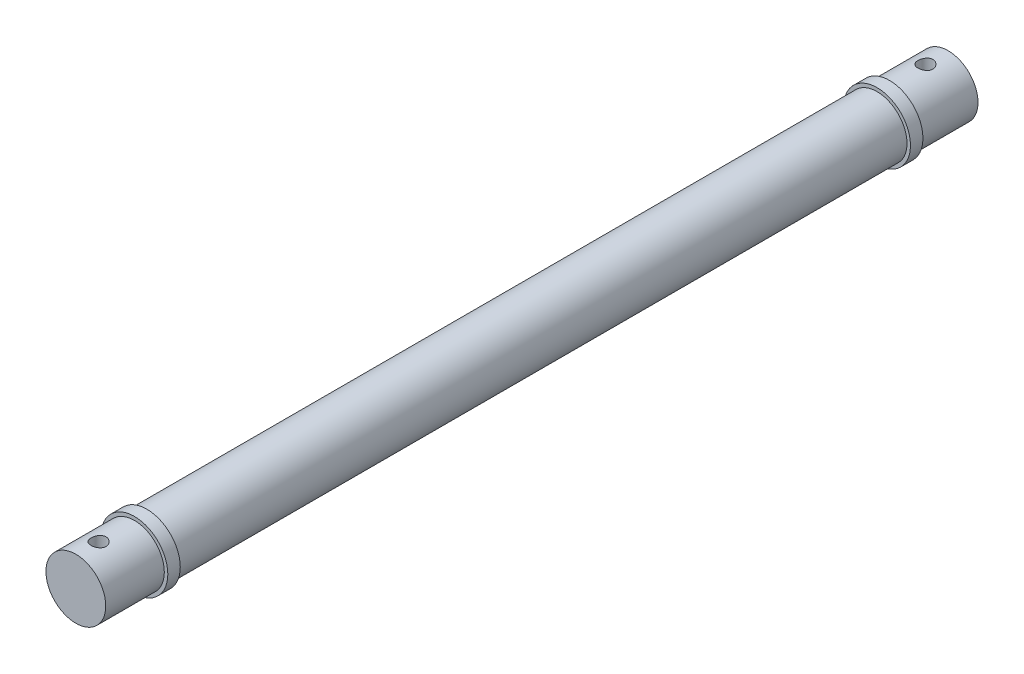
ISO-10303-21;
HEADER;
FILE_DESCRIPTION(('STEP AP214'),'2;1');
FILE_NAME('part.step','',(''),(''),'','','');
FILE_SCHEMA(('AUTOMOTIVE_DESIGN { 1 0 10303 214 1 1 1 1 }'));
ENDSEC;
DATA;
#1=APPLICATION_CONTEXT('core data for automotive mechanical design processes');
#2=APPLICATION_PROTOCOL_DEFINITION('international standard','automotive_design',2000,#1);
#3=PRODUCT_CONTEXT('',#1,'mechanical');
#4=PRODUCT('Part','Part','',(#3));
#5=PRODUCT_RELATED_PRODUCT_CATEGORY('part','',(#4));
#6=PRODUCT_DEFINITION_FORMATION('','',#4);
#7=PRODUCT_DEFINITION_CONTEXT('part definition',#1,'design');
#8=PRODUCT_DEFINITION('design','',#6,#7);
#9=PRODUCT_DEFINITION_SHAPE('','',#8);
#10=(LENGTH_UNIT() NAMED_UNIT(*) SI_UNIT(.MILLI.,.METRE.));
#11=(NAMED_UNIT(*) PLANE_ANGLE_UNIT() SI_UNIT($,.RADIAN.));
#12=(NAMED_UNIT(*) SI_UNIT($,.STERADIAN.) SOLID_ANGLE_UNIT());
#13=UNCERTAINTY_MEASURE_WITH_UNIT(LENGTH_MEASURE(1.E-05),#10,'distance_accuracy_value','');
#14=(GEOMETRIC_REPRESENTATION_CONTEXT(3) GLOBAL_UNCERTAINTY_ASSIGNED_CONTEXT((#13)) GLOBAL_UNIT_ASSIGNED_CONTEXT((#10,
#11,#12)) REPRESENTATION_CONTEXT('',''));
#15=CARTESIAN_POINT('',(0.,0.,0.));
#16=DIRECTION('',(0.,0.,1.));
#17=DIRECTION('',(1.,0.,0.));
#18=AXIS2_PLACEMENT_3D('',#15,#16,#17);
#19=CARTESIAN_POINT('',(0.,0.,65.3));
#20=DIRECTION('',(0.,0.,1.));
#21=DIRECTION('',(1.,0.,0.));
#22=AXIS2_PLACEMENT_3D('',#19,#20,#21);
#23=PLANE('',#22);
#24=CARTESIAN_POINT('',(0.,0.,65.3));
#25=DIRECTION('',(0.,0.,1.));
#26=DIRECTION('',(1.,0.,0.));
#27=AXIS2_PLACEMENT_3D('',#24,#25,#26);
#28=CIRCLE('',#27,2.68);
#29=CARTESIAN_POINT('',(2.68,0.,65.3));
#30=VERTEX_POINT('',#29);
#31=EDGE_CURVE('E11',#30,#30,#28,.T.);
#32=ORIENTED_EDGE('',*,*,#31,.T.);
#33=EDGE_LOOP('',(#32));
#34=FACE_BOUND('',#33,.T.);
#35=CARTESIAN_POINT('',(0.,0.,65.3));
#36=DIRECTION('',(0.,0.,1.));
#37=DIRECTION('',(1.,0.,0.));
#38=AXIS2_PLACEMENT_3D('',#35,#36,#37);
#39=CIRCLE('',#38,2.4);
#40=CARTESIAN_POINT('',(2.4,0.,65.3));
#41=VERTEX_POINT('',#40);
#42=EDGE_CURVE('E49',#41,#41,#39,.T.);
#43=ORIENTED_EDGE('',*,*,#42,.F.);
#44=EDGE_LOOP('',(#43));
#45=FACE_BOUND('',#44,.T.);
#46=ADVANCED_FACE('F38',(#34,#45),#23,.T.);
#47=CARTESIAN_POINT('',(0.,0.,64.3));
#48=DIRECTION('',(0.,0.,1.));
#49=DIRECTION('',(1.,0.,0.));
#50=AXIS2_PLACEMENT_3D('',#47,#48,#49);
#51=PLANE('',#50);
#52=CARTESIAN_POINT('',(0.,0.,64.3));
#53=DIRECTION('',(0.,0.,1.));
#54=DIRECTION('',(1.,0.,0.));
#55=AXIS2_PLACEMENT_3D('',#52,#53,#54);
#56=CIRCLE('',#55,2.68);
#57=CARTESIAN_POINT('',(2.68,0.,64.3));
#58=VERTEX_POINT('',#57);
#59=EDGE_CURVE('E42',#58,#58,#56,.T.);
#60=ORIENTED_EDGE('',*,*,#59,.F.);
#61=EDGE_LOOP('',(#60));
#62=FACE_BOUND('',#61,.T.);
#63=CARTESIAN_POINT('',(0.,0.,64.3));
#64=DIRECTION('',(0.,0.,1.));
#65=DIRECTION('',(1.,0.,0.));
#66=AXIS2_PLACEMENT_3D('',#63,#64,#65);
#67=CIRCLE('',#66,2.4);
#68=CARTESIAN_POINT('',(2.4,0.,64.3));
#69=VERTEX_POINT('',#68);
#70=EDGE_CURVE('E51',#69,#69,#67,.T.);
#71=ORIENTED_EDGE('',*,*,#70,.T.);
#72=EDGE_LOOP('',(#71));
#73=FACE_BOUND('',#72,.T.);
#74=ADVANCED_FACE('F61',(#62,#73),#51,.F.);
#75=CARTESIAN_POINT('',(0.,0.,65.3));
#76=DIRECTION('',(0.,0.,-1.));
#77=DIRECTION('',(-1.,0.,0.));
#78=AXIS2_PLACEMENT_3D('',#75,#76,#77);
#79=CYLINDRICAL_SURFACE('',#78,2.68);
#80=ORIENTED_EDGE('',*,*,#31,.F.);
#81=EDGE_LOOP('',(#80));
#82=FACE_BOUND('',#81,.T.);
#83=ORIENTED_EDGE('',*,*,#59,.T.);
#84=EDGE_LOOP('',(#83));
#85=FACE_BOUND('',#84,.T.);
#86=ADVANCED_FACE('F40',(#82,#85),#79,.T.);
#87=CARTESIAN_POINT('',(0.,0.,65.3));
#88=DIRECTION('',(0.,0.,-1.));
#89=DIRECTION('',(-1.,0.,0.));
#90=AXIS2_PLACEMENT_3D('',#87,#88,#89);
#91=CYLINDRICAL_SURFACE('',#90,2.4);
#92=ORIENTED_EDGE('',*,*,#42,.T.);
#93=EDGE_LOOP('',(#92));
#94=FACE_BOUND('',#93,.T.);
#95=ORIENTED_EDGE('',*,*,#70,.F.);
#96=EDGE_LOOP('',(#95));
#97=FACE_BOUND('',#96,.T.);
#98=ADVANCED_FACE('F57',(#94,#97),#91,.F.);
#99=CLOSED_SHELL('',(#46,#74,#86,#98));
#100=MANIFOLD_SOLID_BREP('B2',#99);
#101=CARTESIAN_POINT('',(0.,0.,4.7));
#102=DIRECTION('',(0.,0.,-1.));
#103=DIRECTION('',(-1.,0.,0.));
#104=AXIS2_PLACEMENT_3D('',#101,#102,#103);
#105=PLANE('',#104);
#106=CARTESIAN_POINT('',(0.,0.,4.7));
#107=DIRECTION('',(0.,0.,-1.));
#108=DIRECTION('',(-1.,0.,0.));
#109=AXIS2_PLACEMENT_3D('',#106,#107,#108);
#110=CIRCLE('',#109,2.68);
#111=CARTESIAN_POINT('',(-2.68,0.,4.7));
#112=VERTEX_POINT('',#111);
#113=EDGE_CURVE('E37',#112,#112,#110,.T.);
#114=ORIENTED_EDGE('',*,*,#113,.T.);
#115=EDGE_LOOP('',(#114));
#116=FACE_BOUND('',#115,.T.);
#117=CARTESIAN_POINT('',(0.,0.,4.7));
#118=DIRECTION('',(0.,0.,-1.));
#119=DIRECTION('',(-1.,0.,0.));
#120=AXIS2_PLACEMENT_3D('',#117,#118,#119);
#121=CIRCLE('',#120,2.4);
#122=CARTESIAN_POINT('',(-2.4,0.,4.7));
#123=VERTEX_POINT('',#122);
#124=EDGE_CURVE('E118',#123,#123,#121,.T.);
#125=ORIENTED_EDGE('',*,*,#124,.F.);
#126=EDGE_LOOP('',(#125));
#127=FACE_BOUND('',#126,.T.);
#128=ADVANCED_FACE('F107',(#116,#127),#105,.T.);
#129=CARTESIAN_POINT('',(0.,0.,5.7));
#130=DIRECTION('',(0.,0.,-1.));
#131=DIRECTION('',(-1.,0.,0.));
#132=AXIS2_PLACEMENT_3D('',#129,#130,#131);
#133=PLANE('',#132);
#134=CARTESIAN_POINT('',(0.,0.,5.7));
#135=DIRECTION('',(0.,0.,-1.));
#136=DIRECTION('',(-1.,0.,0.));
#137=AXIS2_PLACEMENT_3D('',#134,#135,#136);
#138=CIRCLE('',#137,2.68);
#139=CARTESIAN_POINT('',(-2.68,0.,5.7));
#140=VERTEX_POINT('',#139);
#141=EDGE_CURVE('E111',#140,#140,#138,.T.);
#142=ORIENTED_EDGE('',*,*,#141,.F.);
#143=EDGE_LOOP('',(#142));
#144=FACE_BOUND('',#143,.T.);
#145=CARTESIAN_POINT('',(0.,0.,5.7));
#146=DIRECTION('',(0.,0.,-1.));
#147=DIRECTION('',(-1.,0.,0.));
#148=AXIS2_PLACEMENT_3D('',#145,#146,#147);
#149=CIRCLE('',#148,2.4);
#150=CARTESIAN_POINT('',(-2.4,0.,5.7));
#151=VERTEX_POINT('',#150);
#152=EDGE_CURVE('E120',#151,#151,#149,.T.);
#153=ORIENTED_EDGE('',*,*,#152,.T.);
#154=EDGE_LOOP('',(#153));
#155=FACE_BOUND('',#154,.T.);
#156=ADVANCED_FACE('F130',(#144,#155),#133,.F.);
#157=CARTESIAN_POINT('',(0.,0.,4.7));
#158=DIRECTION('',(0.,0.,1.));
#159=DIRECTION('',(1.,0.,0.));
#160=AXIS2_PLACEMENT_3D('',#157,#158,#159);
#161=CYLINDRICAL_SURFACE('',#160,2.68);
#162=ORIENTED_EDGE('',*,*,#113,.F.);
#163=EDGE_LOOP('',(#162));
#164=FACE_BOUND('',#163,.T.);
#165=ORIENTED_EDGE('',*,*,#141,.T.);
#166=EDGE_LOOP('',(#165));
#167=FACE_BOUND('',#166,.T.);
#168=ADVANCED_FACE('F109',(#164,#167),#161,.T.);
#169=CARTESIAN_POINT('',(0.,0.,4.7));
#170=DIRECTION('',(0.,0.,1.));
#171=DIRECTION('',(1.,0.,0.));
#172=AXIS2_PLACEMENT_3D('',#169,#170,#171);
#173=CYLINDRICAL_SURFACE('',#172,2.4);
#174=ORIENTED_EDGE('',*,*,#124,.T.);
#175=EDGE_LOOP('',(#174));
#176=FACE_BOUND('',#175,.T.);
#177=ORIENTED_EDGE('',*,*,#152,.F.);
#178=EDGE_LOOP('',(#177));
#179=FACE_BOUND('',#178,.T.);
#180=ADVANCED_FACE('F126',(#176,#179),#173,.F.);
#181=CLOSED_SHELL('',(#128,#156,#168,#180));
#182=MANIFOLD_SOLID_BREP('B6',#181);
#183=CARTESIAN_POINT('',(0.,0.,70.));
#184=DIRECTION('',(0.,0.,-1.));
#185=DIRECTION('',(-1.,0.,0.));
#186=AXIS2_PLACEMENT_3D('',#183,#184,#185);
#187=CYLINDRICAL_SURFACE('',#186,2.4);
#188=CARTESIAN_POINT('',(0.,2.4,68.7784930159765));
#189=CARTESIAN_POINT('',(0.0331504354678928,2.39999943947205,68.7784920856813));
#190=CARTESIAN_POINT('',(0.0663112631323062,2.39930631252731,68.775736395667));
#191=CARTESIAN_POINT('',(0.131682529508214,2.39660845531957,68.7648029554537));
#192=CARTESIAN_POINT('',(0.163892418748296,2.39460298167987,68.7566221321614));
#193=CARTESIAN_POINT('',(0.226408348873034,2.38950250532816,68.7351173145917));
#194=CARTESIAN_POINT('',(0.256716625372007,2.38640881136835,68.7217994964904));
#195=CARTESIAN_POINT('',(0.314668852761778,2.37946137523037,68.6904204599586));
#196=CARTESIAN_POINT('',(0.342312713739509,2.3756076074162,68.6723590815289));
#197=CARTESIAN_POINT('',(0.394720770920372,2.3674696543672,68.6316127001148));
#198=CARTESIAN_POINT('',(0.419422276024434,2.36317882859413,68.6088483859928));
#199=CARTESIAN_POINT('',(0.464699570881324,2.35469448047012,68.5595121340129));
#200=CARTESIAN_POINT('',(0.485274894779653,2.35050096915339,68.5329397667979));
#201=CARTESIAN_POINT('',(0.522010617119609,2.34261910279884,68.4762549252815));
#202=CARTESIAN_POINT('',(0.53810088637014,2.33893917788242,68.4460957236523));
#203=CARTESIAN_POINT('',(0.564958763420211,2.33259797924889,68.3833936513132));
#204=CARTESIAN_POINT('',(0.575727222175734,2.32993654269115,68.3508511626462));
#205=CARTESIAN_POINT('',(0.591421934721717,2.3260019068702,68.2849956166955));
#206=CARTESIAN_POINT('',(0.596460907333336,2.3247019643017,68.2517110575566));
#207=CARTESIAN_POINT('',(0.60090471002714,2.32355745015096,68.1847455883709));
#208=CARTESIAN_POINT('',(0.60031045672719,2.32371264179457,68.151064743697));
#209=CARTESIAN_POINT('',(0.593594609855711,2.32543682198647,68.0851266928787));
#210=CARTESIAN_POINT('',(0.587607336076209,2.32697145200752,68.0528547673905));
#211=CARTESIAN_POINT('',(0.570489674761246,2.33122683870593,67.989788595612));
#212=CARTESIAN_POINT('',(0.559358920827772,2.33394767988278,67.9589944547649));
#213=CARTESIAN_POINT('',(0.532155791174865,2.34030045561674,67.8993978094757));
#214=CARTESIAN_POINT('',(0.516034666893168,2.34394130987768,67.8706185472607));
#215=CARTESIAN_POINT('',(0.479342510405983,2.35171884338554,67.8161255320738));
#216=CARTESIAN_POINT('',(0.458770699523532,2.35585560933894,67.7904123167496));
#217=CARTESIAN_POINT('',(0.413065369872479,2.36430352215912,67.7420115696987));
#218=CARTESIAN_POINT('',(0.387818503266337,2.36861627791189,67.719431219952));
#219=CARTESIAN_POINT('',(0.333844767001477,2.37682386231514,67.6788045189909));
#220=CARTESIAN_POINT('',(0.305117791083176,2.38071867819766,67.6607583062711));
#221=CARTESIAN_POINT('',(0.244846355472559,2.38767092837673,67.6296727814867));
#222=CARTESIAN_POINT('',(0.213292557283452,2.3907254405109,67.6166508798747));
#223=CARTESIAN_POINT('',(0.148350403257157,2.39563166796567,67.5961260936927));
#224=CARTESIAN_POINT('',(0.114962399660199,2.39748361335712,67.5886221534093));
#225=CARTESIAN_POINT('',(0.0482159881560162,2.3997419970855,67.579509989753));
#226=CARTESIAN_POINT('',(0.0148786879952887,2.40018421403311,67.5777558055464));
#227=CARTESIAN_POINT('',(-0.0516131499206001,2.3996752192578,67.5797926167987));
#228=CARTESIAN_POINT('',(-0.0847677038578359,2.39872413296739,67.5835831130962));
#229=CARTESIAN_POINT('',(-0.149445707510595,2.39555832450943,67.5964813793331));
#230=CARTESIAN_POINT('',(-0.1809860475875,2.39336253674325,67.6055095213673));
#231=CARTESIAN_POINT('',(-0.242102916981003,2.38795482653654,67.6285358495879));
#232=CARTESIAN_POINT('',(-0.271679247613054,2.38474280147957,67.6425345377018));
#233=CARTESIAN_POINT('',(-0.328609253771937,2.37757323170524,67.6753874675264));
#234=CARTESIAN_POINT('',(-0.355914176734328,2.37360346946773,67.6943234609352));
#235=CARTESIAN_POINT('',(-0.407010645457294,2.36537803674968,67.7364089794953));
#236=CARTESIAN_POINT('',(-0.4308015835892,2.36112231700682,67.7595592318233));
#237=CARTESIAN_POINT('',(-0.474796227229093,2.35267582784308,67.8100938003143));
#238=CARTESIAN_POINT('',(-0.494897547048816,2.34848921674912,67.8375680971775));
#239=CARTESIAN_POINT('',(-0.530204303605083,2.34077151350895,67.8955860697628));
#240=CARTESIAN_POINT('',(-0.545409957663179,2.3372403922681,67.9261296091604));
#241=CARTESIAN_POINT('',(-0.570380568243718,2.33127237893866,67.9892553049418));
#242=CARTESIAN_POINT('',(-0.580177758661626,2.32882902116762,68.0218240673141));
#243=CARTESIAN_POINT('',(-0.594138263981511,2.32530697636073,68.0882168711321));
#244=CARTESIAN_POINT('',(-0.598302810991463,2.32422799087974,68.1220406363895));
#245=CARTESIAN_POINT('',(-0.600815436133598,2.32357960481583,68.1889414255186));
#246=CARTESIAN_POINT('',(-0.599327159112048,2.32396773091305,68.2220119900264));
#247=CARTESIAN_POINT('',(-0.590950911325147,2.32611163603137,68.2874145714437));
#248=CARTESIAN_POINT('',(-0.584063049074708,2.32786738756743,68.319746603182));
#249=CARTESIAN_POINT('',(-0.565172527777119,2.33252504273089,68.3825763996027));
#250=CARTESIAN_POINT('',(-0.553200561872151,2.33542006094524,68.4130839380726));
#251=CARTESIAN_POINT('',(-0.524505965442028,2.34203102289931,68.471679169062));
#252=CARTESIAN_POINT('',(-0.507782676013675,2.34574708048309,68.4997665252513));
#253=CARTESIAN_POINT('',(-0.469547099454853,2.35370253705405,68.5535148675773));
#254=CARTESIAN_POINT('',(-0.447921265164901,2.35795305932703,68.5790934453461));
#255=CARTESIAN_POINT('',(-0.400715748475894,2.36643210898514,68.6263118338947));
#256=CARTESIAN_POINT('',(-0.375135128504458,2.37066063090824,68.6479507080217));
#257=CARTESIAN_POINT('',(-0.320187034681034,2.37871062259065,68.6870575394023));
#258=CARTESIAN_POINT('',(-0.290759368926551,2.38252333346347,68.7044428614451));
#259=CARTESIAN_POINT('',(-0.229306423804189,2.38921969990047,68.7339920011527));
#260=CARTESIAN_POINT('',(-0.197283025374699,2.39210402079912,68.7461595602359));
#261=CARTESIAN_POINT('',(-0.137764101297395,2.39619223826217,68.7631217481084));
#262=CARTESIAN_POINT('',(-0.110552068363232,2.39761034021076,68.7688735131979));
#263=CARTESIAN_POINT('',(-0.0555624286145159,2.39951442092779,68.7765593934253));
#264=CARTESIAN_POINT('',(-0.0277848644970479,2.40000046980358,68.7784937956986));
#265=CARTESIAN_POINT('',(0.,2.4,68.7784930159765));
#266=B_SPLINE_CURVE_WITH_KNOTS('',3,(#188,#189,#190,#191,#192,#193,#194,#195,#196,#197,#198,
#199,#200,#201,#202,#203,#204,#205,#206,#207,#208,#209,#210,#211,#212,#213,#214,#215,#216,#217,
#218,#219,#220,#221,#222,#223,#224,#225,#226,#227,#228,#229,#230,#231,#232,#233,#234,#235,#236,
#237,#238,#239,#240,#241,#242,#243,#244,#245,#246,#247,#248,#249,#250,#251,#252,#253,#254,#255,
#256,#257,#258,#259,#260,#261,#262,#263,#264,#265),.UNSPECIFIED.,.T.,.F.,(4,2,2,2,2,2,2,2,2,2,2,
2,2,2,2,2,2,2,2,2,2,2,2,2,2,2,2,2,2,2,2,2,2,2,2,2,2,2,4),(0.,0.0993494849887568,
0.198755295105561,0.298041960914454,0.397331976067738,0.498457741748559,0.599594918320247,
0.70223459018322,0.804857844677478,0.905425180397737,1.0059761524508,1.10408998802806,
1.20221081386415,1.30132211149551,1.40045076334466,1.50240600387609,1.60436435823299,
1.70667291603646,1.80896189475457,1.9086332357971,2.00829560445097,2.10648109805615,
2.20467650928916,2.3046143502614,2.40456945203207,2.50697803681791,2.60938207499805,
2.71116901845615,2.81293369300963,2.91177512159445,3.01061456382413,3.10886560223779,
3.20713027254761,3.30795830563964,3.40881027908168,3.51148874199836,3.6140934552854,
3.69736897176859,3.78063822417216),.UNSPECIFIED.);
#267=CARTESIAN_POINT('',(0.,2.4,68.7784930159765));
#268=VERTEX_POINT('',#267);
#269=EDGE_CURVE('E219',#268,#268,#266,.T.);
#270=ORIENTED_EDGE('',*,*,#269,.F.);
#271=EDGE_LOOP('',(#270));
#272=FACE_BOUND('',#271,.T.);
#273=CARTESIAN_POINT('',(0.,-2.4,2.4215069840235));
#274=CARTESIAN_POINT('',(0.0331504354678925,-2.39999943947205,2.42150605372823));
#275=CARTESIAN_POINT('',(0.0663112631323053,-2.39930631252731,2.41875036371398));
#276=CARTESIAN_POINT('',(0.131682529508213,-2.39660845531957,2.40781692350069));
#277=CARTESIAN_POINT('',(0.163892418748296,-2.39460298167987,2.39963610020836));
#278=CARTESIAN_POINT('',(0.226408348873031,-2.38950250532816,2.37813128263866));
#279=CARTESIAN_POINT('',(0.256716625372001,-2.38640881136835,2.36481346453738));
#280=CARTESIAN_POINT('',(0.31466885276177,-2.37946137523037,2.33343442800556));
#281=CARTESIAN_POINT('',(0.342312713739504,-2.3756076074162,2.31537304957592));
#282=CARTESIAN_POINT('',(0.394720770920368,-2.3674696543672,2.27462666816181));
#283=CARTESIAN_POINT('',(0.419422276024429,-2.36317882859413,2.25186235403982));
#284=CARTESIAN_POINT('',(0.464699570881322,-2.35469448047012,2.20252610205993));
#285=CARTESIAN_POINT('',(0.485274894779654,-2.35050096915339,2.1759537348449));
#286=CARTESIAN_POINT('',(0.522010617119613,-2.34261910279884,2.11926889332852));
#287=CARTESIAN_POINT('',(0.538100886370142,-2.33893917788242,2.08910969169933));
#288=CARTESIAN_POINT('',(0.564958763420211,-2.33259797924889,2.02640761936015));
#289=CARTESIAN_POINT('',(0.575727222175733,-2.32993654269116,1.99386513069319));
#290=CARTESIAN_POINT('',(0.591421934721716,-2.3260019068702,1.92800958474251));
#291=CARTESIAN_POINT('',(0.596460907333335,-2.3247019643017,1.89472502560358));
#292=CARTESIAN_POINT('',(0.600904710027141,-2.32355745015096,1.8277595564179));
#293=CARTESIAN_POINT('',(0.600310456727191,-2.32371264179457,1.79407871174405));
#294=CARTESIAN_POINT('',(0.593594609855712,-2.32543682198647,1.7281406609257));
#295=CARTESIAN_POINT('',(0.587607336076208,-2.32697145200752,1.69586873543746));
#296=CARTESIAN_POINT('',(0.570489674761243,-2.33122683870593,1.63280256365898));
#297=CARTESIAN_POINT('',(0.559358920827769,-2.33394767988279,1.6020084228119));
#298=CARTESIAN_POINT('',(0.532155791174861,-2.34030045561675,1.54241177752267));
#299=CARTESIAN_POINT('',(0.516034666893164,-2.34394130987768,1.51363251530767));
#300=CARTESIAN_POINT('',(0.479342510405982,-2.35171884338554,1.45913950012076));
#301=CARTESIAN_POINT('',(0.458770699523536,-2.35585560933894,1.43342628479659));
#302=CARTESIAN_POINT('',(0.413065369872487,-2.36430352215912,1.38502553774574));
#303=CARTESIAN_POINT('',(0.387818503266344,-2.36861627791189,1.36244518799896));
#304=CARTESIAN_POINT('',(0.33384476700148,-2.37682386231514,1.32181848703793));
#305=CARTESIAN_POINT('',(0.305117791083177,-2.38071867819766,1.30377227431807));
#306=CARTESIAN_POINT('',(0.244846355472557,-2.38767092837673,1.27268674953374));
#307=CARTESIAN_POINT('',(0.213292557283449,-2.3907254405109,1.25966484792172));
#308=CARTESIAN_POINT('',(0.148350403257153,-2.39563166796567,1.23914006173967));
#309=CARTESIAN_POINT('',(0.114962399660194,-2.39748361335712,1.23163612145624));
#310=CARTESIAN_POINT('',(0.0482159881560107,-2.3997419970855,1.22252395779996));
#311=CARTESIAN_POINT('',(0.0148786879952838,-2.40018421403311,1.22076977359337));
#312=CARTESIAN_POINT('',(-0.0516131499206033,-2.3996752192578,1.22280658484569));
#313=CARTESIAN_POINT('',(-0.084767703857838,-2.39872413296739,1.22659708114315));
#314=CARTESIAN_POINT('',(-0.149445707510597,-2.39555832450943,1.23949534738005));
#315=CARTESIAN_POINT('',(-0.180986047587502,-2.39336253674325,1.24852348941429));
#316=CARTESIAN_POINT('',(-0.242102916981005,-2.38795482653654,1.27154981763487));
#317=CARTESIAN_POINT('',(-0.271679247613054,-2.38474280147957,1.28554850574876));
#318=CARTESIAN_POINT('',(-0.328609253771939,-2.37757323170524,1.31840143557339));
#319=CARTESIAN_POINT('',(-0.355914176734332,-2.37360346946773,1.3373374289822));
#320=CARTESIAN_POINT('',(-0.407010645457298,-2.36537803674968,1.37942294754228));
#321=CARTESIAN_POINT('',(-0.430801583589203,-2.36112231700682,1.40257319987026));
#322=CARTESIAN_POINT('',(-0.474796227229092,-2.35267582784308,1.45310776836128));
#323=CARTESIAN_POINT('',(-0.494897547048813,-2.34848921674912,1.48058206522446));
#324=CARTESIAN_POINT('',(-0.530204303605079,-2.34077151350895,1.53860003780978));
#325=CARTESIAN_POINT('',(-0.545409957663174,-2.3372403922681,1.5691435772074));
#326=CARTESIAN_POINT('',(-0.570380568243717,-2.33127237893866,1.63226927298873));
#327=CARTESIAN_POINT('',(-0.580177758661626,-2.32882902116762,1.6648380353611));
#328=CARTESIAN_POINT('',(-0.594138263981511,-2.32530697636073,1.73123083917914));
#329=CARTESIAN_POINT('',(-0.598302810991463,-2.32422799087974,1.76505460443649));
#330=CARTESIAN_POINT('',(-0.600815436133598,-2.32357960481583,1.83195539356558));
#331=CARTESIAN_POINT('',(-0.599327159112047,-2.32396773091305,1.86502595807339));
#332=CARTESIAN_POINT('',(-0.590950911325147,-2.32611163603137,1.93042853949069));
#333=CARTESIAN_POINT('',(-0.584063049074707,-2.32786738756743,1.96276057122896));
#334=CARTESIAN_POINT('',(-0.565172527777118,-2.33252504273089,2.02559036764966));
#335=CARTESIAN_POINT('',(-0.55320056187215,-2.33542006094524,2.05609790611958));
#336=CARTESIAN_POINT('',(-0.524505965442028,-2.34203102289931,2.11469313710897));
#337=CARTESIAN_POINT('',(-0.507782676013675,-2.34574708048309,2.14278049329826));
#338=CARTESIAN_POINT('',(-0.469547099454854,-2.35370253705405,2.1965288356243));
#339=CARTESIAN_POINT('',(-0.447921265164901,-2.35795305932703,2.22210741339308));
#340=CARTESIAN_POINT('',(-0.400715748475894,-2.36643210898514,2.26932580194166));
#341=CARTESIAN_POINT('',(-0.375135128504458,-2.37066063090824,2.29096467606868));
#342=CARTESIAN_POINT('',(-0.320187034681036,-2.37871062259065,2.33007150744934));
#343=CARTESIAN_POINT('',(-0.290759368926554,-2.38252333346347,2.34745682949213));
#344=CARTESIAN_POINT('',(-0.22930642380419,-2.38921969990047,2.37700596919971));
#345=CARTESIAN_POINT('',(-0.197283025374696,-2.39210402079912,2.38917352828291));
#346=CARTESIAN_POINT('',(-0.137764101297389,-2.39619223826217,2.40613571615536));
#347=CARTESIAN_POINT('',(-0.110552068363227,-2.39761034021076,2.41188748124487));
#348=CARTESIAN_POINT('',(-0.0555624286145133,-2.39951442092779,2.41957336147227));
#349=CARTESIAN_POINT('',(-0.0277848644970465,-2.40000046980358,2.42150776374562));
#350=CARTESIAN_POINT('',(0.,-2.4,2.4215069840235));
#351=B_SPLINE_CURVE_WITH_KNOTS('',3,(#273,#274,#275,#276,#277,#278,#279,#280,#281,#282,#283,
#284,#285,#286,#287,#288,#289,#290,#291,#292,#293,#294,#295,#296,#297,#298,#299,#300,#301,#302,
#303,#304,#305,#306,#307,#308,#309,#310,#311,#312,#313,#314,#315,#316,#317,#318,#319,#320,#321,
#322,#323,#324,#325,#326,#327,#328,#329,#330,#331,#332,#333,#334,#335,#336,#337,#338,#339,#340,
#341,#342,#343,#344,#345,#346,#347,#348,#349,#350),.UNSPECIFIED.,.T.,.F.,(4,2,2,2,2,2,2,2,2,2,2,
2,2,2,2,2,2,2,2,2,2,2,2,2,2,2,2,2,2,2,2,2,2,2,2,2,2,2,4),(0.,0.099349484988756,0.19875529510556,
0.298041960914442,0.397331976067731,0.498457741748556,0.599594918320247,0.702234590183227,
0.804857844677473,0.905425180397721,1.00597615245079,1.10408998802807,1.20221081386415,
1.30132211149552,1.40045076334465,1.50240600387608,1.60436435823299,1.70667291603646,
1.80896189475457,1.9086332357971,2.00829560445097,2.10648109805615,2.20467650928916,
2.30461435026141,2.40456945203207,2.5069780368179,2.60938207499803,2.71116901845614,
2.81293369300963,2.91177512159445,3.01061456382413,3.10886560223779,3.2071302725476,
3.30795830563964,3.40881027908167,3.51148874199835,3.6140934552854,3.69736897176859,
3.78063822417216),.UNSPECIFIED.);
#352=CARTESIAN_POINT('',(0.,-2.4,2.4215069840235));
#353=VERTEX_POINT('',#352);
#354=EDGE_CURVE('E185',#353,#353,#351,.T.);
#355=ORIENTED_EDGE('',*,*,#354,.T.);
#356=EDGE_LOOP('',(#355));
#357=FACE_BOUND('',#356,.T.);
#358=CARTESIAN_POINT('',(0.,2.4,2.4215069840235));
#359=CARTESIAN_POINT('',(-0.0331504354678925,2.39999943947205,2.42150605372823));
#360=CARTESIAN_POINT('',(-0.0663112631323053,2.39930631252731,2.41875036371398));
#361=CARTESIAN_POINT('',(-0.131682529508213,2.39660845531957,2.40781692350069));
#362=CARTESIAN_POINT('',(-0.163892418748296,2.39460298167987,2.39963610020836));
#363=CARTESIAN_POINT('',(-0.226408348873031,2.38950250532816,2.37813128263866));
#364=CARTESIAN_POINT('',(-0.256716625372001,2.38640881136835,2.36481346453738));
#365=CARTESIAN_POINT('',(-0.31466885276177,2.37946137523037,2.33343442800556));
#366=CARTESIAN_POINT('',(-0.342312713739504,2.3756076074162,2.31537304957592));
#367=CARTESIAN_POINT('',(-0.394720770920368,2.3674696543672,2.27462666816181));
#368=CARTESIAN_POINT('',(-0.419422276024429,2.36317882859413,2.25186235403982));
#369=CARTESIAN_POINT('',(-0.464699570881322,2.35469448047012,2.20252610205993));
#370=CARTESIAN_POINT('',(-0.485274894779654,2.35050096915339,2.1759537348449));
#371=CARTESIAN_POINT('',(-0.522010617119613,2.34261910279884,2.11926889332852));
#372=CARTESIAN_POINT('',(-0.538100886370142,2.33893917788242,2.08910969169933));
#373=CARTESIAN_POINT('',(-0.564958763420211,2.33259797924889,2.02640761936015));
#374=CARTESIAN_POINT('',(-0.575727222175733,2.32993654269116,1.99386513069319));
#375=CARTESIAN_POINT('',(-0.591421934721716,2.3260019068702,1.92800958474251));
#376=CARTESIAN_POINT('',(-0.596460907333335,2.3247019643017,1.89472502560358));
#377=CARTESIAN_POINT('',(-0.600904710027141,2.32355745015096,1.8277595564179));
#378=CARTESIAN_POINT('',(-0.600310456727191,2.32371264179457,1.79407871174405));
#379=CARTESIAN_POINT('',(-0.593594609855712,2.32543682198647,1.7281406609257));
#380=CARTESIAN_POINT('',(-0.587607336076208,2.32697145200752,1.69586873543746));
#381=CARTESIAN_POINT('',(-0.570489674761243,2.33122683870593,1.63280256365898));
#382=CARTESIAN_POINT('',(-0.559358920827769,2.33394767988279,1.6020084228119));
#383=CARTESIAN_POINT('',(-0.532155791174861,2.34030045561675,1.54241177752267));
#384=CARTESIAN_POINT('',(-0.516034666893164,2.34394130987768,1.51363251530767));
#385=CARTESIAN_POINT('',(-0.479342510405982,2.35171884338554,1.45913950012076));
#386=CARTESIAN_POINT('',(-0.458770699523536,2.35585560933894,1.43342628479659));
#387=CARTESIAN_POINT('',(-0.413065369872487,2.36430352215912,1.38502553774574));
#388=CARTESIAN_POINT('',(-0.387818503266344,2.36861627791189,1.36244518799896));
#389=CARTESIAN_POINT('',(-0.33384476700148,2.37682386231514,1.32181848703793));
#390=CARTESIAN_POINT('',(-0.305117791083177,2.38071867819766,1.30377227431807));
#391=CARTESIAN_POINT('',(-0.244846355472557,2.38767092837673,1.27268674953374));
#392=CARTESIAN_POINT('',(-0.213292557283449,2.3907254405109,1.25966484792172));
#393=CARTESIAN_POINT('',(-0.148350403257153,2.39563166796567,1.23914006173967));
#394=CARTESIAN_POINT('',(-0.114962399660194,2.39748361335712,1.23163612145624));
#395=CARTESIAN_POINT('',(-0.0482159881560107,2.3997419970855,1.22252395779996));
#396=CARTESIAN_POINT('',(-0.0148786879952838,2.40018421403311,1.22076977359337));
#397=CARTESIAN_POINT('',(0.0516131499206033,2.3996752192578,1.22280658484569));
#398=CARTESIAN_POINT('',(0.084767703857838,2.39872413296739,1.22659708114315));
#399=CARTESIAN_POINT('',(0.149445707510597,2.39555832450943,1.23949534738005));
#400=CARTESIAN_POINT('',(0.180986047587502,2.39336253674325,1.24852348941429));
#401=CARTESIAN_POINT('',(0.242102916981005,2.38795482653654,1.27154981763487));
#402=CARTESIAN_POINT('',(0.271679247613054,2.38474280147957,1.28554850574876));
#403=CARTESIAN_POINT('',(0.328609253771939,2.37757323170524,1.31840143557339));
#404=CARTESIAN_POINT('',(0.355914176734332,2.37360346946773,1.3373374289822));
#405=CARTESIAN_POINT('',(0.407010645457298,2.36537803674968,1.37942294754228));
#406=CARTESIAN_POINT('',(0.430801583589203,2.36112231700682,1.40257319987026));
#407=CARTESIAN_POINT('',(0.474796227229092,2.35267582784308,1.45310776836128));
#408=CARTESIAN_POINT('',(0.494897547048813,2.34848921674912,1.48058206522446));
#409=CARTESIAN_POINT('',(0.530204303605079,2.34077151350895,1.53860003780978));
#410=CARTESIAN_POINT('',(0.545409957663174,2.3372403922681,1.5691435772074));
#411=CARTESIAN_POINT('',(0.570380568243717,2.33127237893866,1.63226927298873));
#412=CARTESIAN_POINT('',(0.580177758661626,2.32882902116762,1.6648380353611));
#413=CARTESIAN_POINT('',(0.594138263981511,2.32530697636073,1.73123083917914));
#414=CARTESIAN_POINT('',(0.598302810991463,2.32422799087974,1.76505460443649));
#415=CARTESIAN_POINT('',(0.600815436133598,2.32357960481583,1.83195539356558));
#416=CARTESIAN_POINT('',(0.599327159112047,2.32396773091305,1.86502595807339));
#417=CARTESIAN_POINT('',(0.590950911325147,2.32611163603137,1.93042853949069));
#418=CARTESIAN_POINT('',(0.584063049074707,2.32786738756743,1.96276057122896));
#419=CARTESIAN_POINT('',(0.565172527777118,2.33252504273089,2.02559036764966));
#420=CARTESIAN_POINT('',(0.55320056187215,2.33542006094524,2.05609790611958));
#421=CARTESIAN_POINT('',(0.524505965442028,2.34203102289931,2.11469313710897));
#422=CARTESIAN_POINT('',(0.507782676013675,2.34574708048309,2.14278049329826));
#423=CARTESIAN_POINT('',(0.469547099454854,2.35370253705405,2.1965288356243));
#424=CARTESIAN_POINT('',(0.447921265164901,2.35795305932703,2.22210741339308));
#425=CARTESIAN_POINT('',(0.400715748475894,2.36643210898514,2.26932580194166));
#426=CARTESIAN_POINT('',(0.375135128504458,2.37066063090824,2.29096467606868));
#427=CARTESIAN_POINT('',(0.320187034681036,2.37871062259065,2.33007150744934));
#428=CARTESIAN_POINT('',(0.290759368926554,2.38252333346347,2.34745682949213));
#429=CARTESIAN_POINT('',(0.22930642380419,2.38921969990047,2.37700596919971));
#430=CARTESIAN_POINT('',(0.197283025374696,2.39210402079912,2.38917352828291));
#431=CARTESIAN_POINT('',(0.137764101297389,2.39619223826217,2.40613571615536));
#432=CARTESIAN_POINT('',(0.110552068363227,2.39761034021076,2.41188748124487));
#433=CARTESIAN_POINT('',(0.0555624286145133,2.39951442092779,2.41957336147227));
#434=CARTESIAN_POINT('',(0.0277848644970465,2.40000046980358,2.42150776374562));
#435=CARTESIAN_POINT('',(0.,2.4,2.4215069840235));
#436=B_SPLINE_CURVE_WITH_KNOTS('',3,(#358,#359,#360,#361,#362,#363,#364,#365,#366,#367,#368,
#369,#370,#371,#372,#373,#374,#375,#376,#377,#378,#379,#380,#381,#382,#383,#384,#385,#386,#387,
#388,#389,#390,#391,#392,#393,#394,#395,#396,#397,#398,#399,#400,#401,#402,#403,#404,#405,#406,
#407,#408,#409,#410,#411,#412,#413,#414,#415,#416,#417,#418,#419,#420,#421,#422,#423,#424,#425,
#426,#427,#428,#429,#430,#431,#432,#433,#434,#435),.UNSPECIFIED.,.T.,.F.,(4,2,2,2,2,2,2,2,2,2,2,
2,2,2,2,2,2,2,2,2,2,2,2,2,2,2,2,2,2,2,2,2,2,2,2,2,2,2,4),(0.,0.099349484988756,0.19875529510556,
0.298041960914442,0.397331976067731,0.498457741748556,0.599594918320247,0.702234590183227,
0.804857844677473,0.905425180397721,1.00597615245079,1.10408998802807,1.20221081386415,
1.30132211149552,1.40045076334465,1.50240600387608,1.60436435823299,1.70667291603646,
1.80896189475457,1.9086332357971,2.00829560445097,2.10648109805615,2.20467650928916,
2.30461435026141,2.40456945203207,2.5069780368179,2.60938207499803,2.71116901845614,
2.81293369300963,2.91177512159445,3.01061456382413,3.10886560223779,3.2071302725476,
3.30795830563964,3.40881027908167,3.51148874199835,3.6140934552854,3.69736897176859,
3.78063822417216),.UNSPECIFIED.);
#437=CARTESIAN_POINT('',(0.,2.4,2.4215069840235));
#438=VERTEX_POINT('',#437);
#439=EDGE_CURVE('E188',#438,#438,#436,.T.);
#440=ORIENTED_EDGE('',*,*,#439,.T.);
#441=EDGE_LOOP('',(#440));
#442=FACE_BOUND('',#441,.T.);
#443=CARTESIAN_POINT('',(0.,0.,70.));
#444=DIRECTION('',(0.,0.,1.));
#445=DIRECTION('',(1.,0.,0.));
#446=AXIS2_PLACEMENT_3D('',#443,#444,#445);
#447=CIRCLE('',#446,2.4);
#448=CARTESIAN_POINT('',(2.4,0.,70.));
#449=VERTEX_POINT('',#448);
#450=EDGE_CURVE('E106',#449,#449,#447,.T.);
#451=ORIENTED_EDGE('',*,*,#450,.F.);
#452=EDGE_LOOP('',(#451));
#453=FACE_BOUND('',#452,.T.);
#454=CARTESIAN_POINT('',(0.,0.,0.));
#455=DIRECTION('',(0.,0.,1.));
#456=DIRECTION('',(1.,0.,0.));
#457=AXIS2_PLACEMENT_3D('',#454,#455,#456);
#458=CIRCLE('',#457,2.4);
#459=CARTESIAN_POINT('',(2.4,0.,0.));
#460=VERTEX_POINT('',#459);
#461=EDGE_CURVE('E180',#460,#460,#458,.T.);
#462=ORIENTED_EDGE('',*,*,#461,.T.);
#463=EDGE_LOOP('',(#462));
#464=FACE_BOUND('',#463,.T.);
#465=CARTESIAN_POINT('',(0.,-2.4,68.7784930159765));
#466=CARTESIAN_POINT('',(-0.0331504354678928,-2.39999943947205,68.7784920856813));
#467=CARTESIAN_POINT('',(-0.0663112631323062,-2.39930631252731,68.775736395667));
#468=CARTESIAN_POINT('',(-0.131682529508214,-2.39660845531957,68.7648029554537));
#469=CARTESIAN_POINT('',(-0.163892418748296,-2.39460298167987,68.7566221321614));
#470=CARTESIAN_POINT('',(-0.226408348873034,-2.38950250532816,68.7351173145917));
#471=CARTESIAN_POINT('',(-0.256716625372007,-2.38640881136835,68.7217994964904));
#472=CARTESIAN_POINT('',(-0.314668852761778,-2.37946137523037,68.6904204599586));
#473=CARTESIAN_POINT('',(-0.342312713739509,-2.3756076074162,68.6723590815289));
#474=CARTESIAN_POINT('',(-0.394720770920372,-2.3674696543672,68.6316127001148));
#475=CARTESIAN_POINT('',(-0.419422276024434,-2.36317882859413,68.6088483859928));
#476=CARTESIAN_POINT('',(-0.464699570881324,-2.35469448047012,68.5595121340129));
#477=CARTESIAN_POINT('',(-0.485274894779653,-2.35050096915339,68.5329397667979));
#478=CARTESIAN_POINT('',(-0.522010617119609,-2.34261910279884,68.4762549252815));
#479=CARTESIAN_POINT('',(-0.53810088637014,-2.33893917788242,68.4460957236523));
#480=CARTESIAN_POINT('',(-0.564958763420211,-2.33259797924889,68.3833936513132));
#481=CARTESIAN_POINT('',(-0.575727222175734,-2.32993654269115,68.3508511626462));
#482=CARTESIAN_POINT('',(-0.591421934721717,-2.3260019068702,68.2849956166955));
#483=CARTESIAN_POINT('',(-0.596460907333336,-2.3247019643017,68.2517110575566));
#484=CARTESIAN_POINT('',(-0.60090471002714,-2.32355745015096,68.1847455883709));
#485=CARTESIAN_POINT('',(-0.60031045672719,-2.32371264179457,68.151064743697));
#486=CARTESIAN_POINT('',(-0.593594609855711,-2.32543682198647,68.0851266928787));
#487=CARTESIAN_POINT('',(-0.587607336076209,-2.32697145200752,68.0528547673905));
#488=CARTESIAN_POINT('',(-0.570489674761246,-2.33122683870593,67.989788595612));
#489=CARTESIAN_POINT('',(-0.559358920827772,-2.33394767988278,67.9589944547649));
#490=CARTESIAN_POINT('',(-0.532155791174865,-2.34030045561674,67.8993978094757));
#491=CARTESIAN_POINT('',(-0.516034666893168,-2.34394130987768,67.8706185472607));
#492=CARTESIAN_POINT('',(-0.479342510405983,-2.35171884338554,67.8161255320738));
#493=CARTESIAN_POINT('',(-0.458770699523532,-2.35585560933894,67.7904123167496));
#494=CARTESIAN_POINT('',(-0.413065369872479,-2.36430352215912,67.7420115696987));
#495=CARTESIAN_POINT('',(-0.387818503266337,-2.36861627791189,67.719431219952));
#496=CARTESIAN_POINT('',(-0.333844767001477,-2.37682386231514,67.6788045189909));
#497=CARTESIAN_POINT('',(-0.305117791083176,-2.38071867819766,67.6607583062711));
#498=CARTESIAN_POINT('',(-0.244846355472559,-2.38767092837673,67.6296727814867));
#499=CARTESIAN_POINT('',(-0.213292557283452,-2.3907254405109,67.6166508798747));
#500=CARTESIAN_POINT('',(-0.148350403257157,-2.39563166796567,67.5961260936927));
#501=CARTESIAN_POINT('',(-0.114962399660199,-2.39748361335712,67.5886221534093));
#502=CARTESIAN_POINT('',(-0.0482159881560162,-2.3997419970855,67.579509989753));
#503=CARTESIAN_POINT('',(-0.0148786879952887,-2.40018421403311,67.5777558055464));
#504=CARTESIAN_POINT('',(0.0516131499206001,-2.3996752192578,67.5797926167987));
#505=CARTESIAN_POINT('',(0.0847677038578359,-2.39872413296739,67.5835831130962));
#506=CARTESIAN_POINT('',(0.149445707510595,-2.39555832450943,67.5964813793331));
#507=CARTESIAN_POINT('',(0.1809860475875,-2.39336253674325,67.6055095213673));
#508=CARTESIAN_POINT('',(0.242102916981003,-2.38795482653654,67.6285358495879));
#509=CARTESIAN_POINT('',(0.271679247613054,-2.38474280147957,67.6425345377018));
#510=CARTESIAN_POINT('',(0.328609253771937,-2.37757323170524,67.6753874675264));
#511=CARTESIAN_POINT('',(0.355914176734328,-2.37360346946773,67.6943234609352));
#512=CARTESIAN_POINT('',(0.407010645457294,-2.36537803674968,67.7364089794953));
#513=CARTESIAN_POINT('',(0.4308015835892,-2.36112231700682,67.7595592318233));
#514=CARTESIAN_POINT('',(0.474796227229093,-2.35267582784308,67.8100938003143));
#515=CARTESIAN_POINT('',(0.494897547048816,-2.34848921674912,67.8375680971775));
#516=CARTESIAN_POINT('',(0.530204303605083,-2.34077151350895,67.8955860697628));
#517=CARTESIAN_POINT('',(0.545409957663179,-2.3372403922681,67.9261296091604));
#518=CARTESIAN_POINT('',(0.570380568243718,-2.33127237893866,67.9892553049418));
#519=CARTESIAN_POINT('',(0.580177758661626,-2.32882902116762,68.0218240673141));
#520=CARTESIAN_POINT('',(0.594138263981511,-2.32530697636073,68.0882168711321));
#521=CARTESIAN_POINT('',(0.598302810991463,-2.32422799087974,68.1220406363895));
#522=CARTESIAN_POINT('',(0.600815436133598,-2.32357960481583,68.1889414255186));
#523=CARTESIAN_POINT('',(0.599327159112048,-2.32396773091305,68.2220119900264));
#524=CARTESIAN_POINT('',(0.590950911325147,-2.32611163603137,68.2874145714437));
#525=CARTESIAN_POINT('',(0.584063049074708,-2.32786738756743,68.319746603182));
#526=CARTESIAN_POINT('',(0.565172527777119,-2.33252504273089,68.3825763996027));
#527=CARTESIAN_POINT('',(0.553200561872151,-2.33542006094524,68.4130839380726));
#528=CARTESIAN_POINT('',(0.524505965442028,-2.34203102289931,68.471679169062));
#529=CARTESIAN_POINT('',(0.507782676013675,-2.34574708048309,68.4997665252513));
#530=CARTESIAN_POINT('',(0.469547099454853,-2.35370253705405,68.5535148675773));
#531=CARTESIAN_POINT('',(0.447921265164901,-2.35795305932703,68.5790934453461));
#532=CARTESIAN_POINT('',(0.400715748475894,-2.36643210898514,68.6263118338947));
#533=CARTESIAN_POINT('',(0.375135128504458,-2.37066063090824,68.6479507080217));
#534=CARTESIAN_POINT('',(0.320187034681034,-2.37871062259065,68.6870575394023));
#535=CARTESIAN_POINT('',(0.290759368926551,-2.38252333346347,68.7044428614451));
#536=CARTESIAN_POINT('',(0.229306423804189,-2.38921969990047,68.7339920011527));
#537=CARTESIAN_POINT('',(0.197283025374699,-2.39210402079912,68.7461595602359));
#538=CARTESIAN_POINT('',(0.137764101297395,-2.39619223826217,68.7631217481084));
#539=CARTESIAN_POINT('',(0.110552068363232,-2.39761034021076,68.7688735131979));
#540=CARTESIAN_POINT('',(0.0555624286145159,-2.39951442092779,68.7765593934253));
#541=CARTESIAN_POINT('',(0.0277848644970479,-2.40000046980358,68.7784937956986));
#542=CARTESIAN_POINT('',(0.,-2.4,68.7784930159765));
#543=B_SPLINE_CURVE_WITH_KNOTS('',3,(#465,#466,#467,#468,#469,#470,#471,#472,#473,#474,#475,
#476,#477,#478,#479,#480,#481,#482,#483,#484,#485,#486,#487,#488,#489,#490,#491,#492,#493,#494,
#495,#496,#497,#498,#499,#500,#501,#502,#503,#504,#505,#506,#507,#508,#509,#510,#511,#512,#513,
#514,#515,#516,#517,#518,#519,#520,#521,#522,#523,#524,#525,#526,#527,#528,#529,#530,#531,#532,
#533,#534,#535,#536,#537,#538,#539,#540,#541,#542),.UNSPECIFIED.,.T.,.F.,(4,2,2,2,2,2,2,2,2,2,2,
2,2,2,2,2,2,2,2,2,2,2,2,2,2,2,2,2,2,2,2,2,2,2,2,2,2,2,4),(0.,0.0993494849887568,
0.198755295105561,0.298041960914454,0.397331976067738,0.498457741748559,0.599594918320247,
0.70223459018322,0.804857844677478,0.905425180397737,1.0059761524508,1.10408998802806,
1.20221081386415,1.30132211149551,1.40045076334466,1.50240600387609,1.60436435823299,
1.70667291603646,1.80896189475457,1.9086332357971,2.00829560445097,2.10648109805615,
2.20467650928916,2.3046143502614,2.40456945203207,2.50697803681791,2.60938207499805,
2.71116901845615,2.81293369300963,2.91177512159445,3.01061456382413,3.10886560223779,
3.20713027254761,3.30795830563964,3.40881027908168,3.51148874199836,3.6140934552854,
3.69736897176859,3.78063822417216),.UNSPECIFIED.);
#544=CARTESIAN_POINT('',(0.,-2.4,68.7784930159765));
#545=VERTEX_POINT('',#544);
#546=EDGE_CURVE('E173',#545,#545,#543,.T.);
#547=ORIENTED_EDGE('',*,*,#546,.F.);
#548=EDGE_LOOP('',(#547));
#549=FACE_BOUND('',#548,.T.);
#550=ADVANCED_FACE('F169',(#272,#357,#442,#453,#464,#549),#187,.T.);
#551=CARTESIAN_POINT('',(0.,0.,70.));
#552=DIRECTION('',(0.,0.,1.));
#553=DIRECTION('',(1.,0.,0.));
#554=AXIS2_PLACEMENT_3D('',#551,#552,#553);
#555=PLANE('',#554);
#556=ORIENTED_EDGE('',*,*,#450,.T.);
#557=EDGE_LOOP('',(#556));
#558=FACE_BOUND('',#557,.T.);
#559=ADVANCED_FACE('F204',(#558),#555,.T.);
#560=CARTESIAN_POINT('',(0.,0.,0.));
#561=DIRECTION('',(0.,0.,1.));
#562=DIRECTION('',(1.,0.,0.));
#563=AXIS2_PLACEMENT_3D('',#560,#561,#562);
#564=PLANE('',#563);
#565=ORIENTED_EDGE('',*,*,#461,.F.);
#566=EDGE_LOOP('',(#565));
#567=FACE_BOUND('',#566,.T.);
#568=ADVANCED_FACE('F201',(#567),#564,.F.);
#569=CARTESIAN_POINT('',(0.,-5.,1.8215069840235));
#570=DIRECTION('',(0.,1.,0.));
#571=DIRECTION('',(0.,0.,1.));
#572=AXIS2_PLACEMENT_3D('',#569,#570,#571);
#573=CYLINDRICAL_SURFACE('',#572,0.6);
#574=ORIENTED_EDGE('',*,*,#439,.F.);
#575=EDGE_LOOP('',(#574));
#576=FACE_BOUND('',#575,.T.);
#577=ORIENTED_EDGE('',*,*,#354,.F.);
#578=EDGE_LOOP('',(#577));
#579=FACE_BOUND('',#578,.T.);
#580=ADVANCED_FACE('F196',(#576,#579),#573,.F.);
#581=CARTESIAN_POINT('',(0.,-5.,68.1784930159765));
#582=DIRECTION('',(0.,1.,0.));
#583=DIRECTION('',(0.,0.,1.));
#584=AXIS2_PLACEMENT_3D('',#581,#582,#583);
#585=CYLINDRICAL_SURFACE('',#584,0.6);
#586=ORIENTED_EDGE('',*,*,#269,.T.);
#587=EDGE_LOOP('',(#586));
#588=FACE_BOUND('',#587,.T.);
#589=ORIENTED_EDGE('',*,*,#546,.T.);
#590=EDGE_LOOP('',(#589));
#591=FACE_BOUND('',#590,.T.);
#592=ADVANCED_FACE('F200',(#588,#591),#585,.F.);
#593=CLOSED_SHELL('',(#550,#559,#568,#580,#592));
#594=MANIFOLD_SOLID_BREP('B32',#593);
#595=ADVANCED_BREP_SHAPE_REPRESENTATION('',(#18,#100,#182,#594),#14);
#596=SHAPE_DEFINITION_REPRESENTATION(#9,#595);
ENDSEC;
END-ISO-10303-21;
